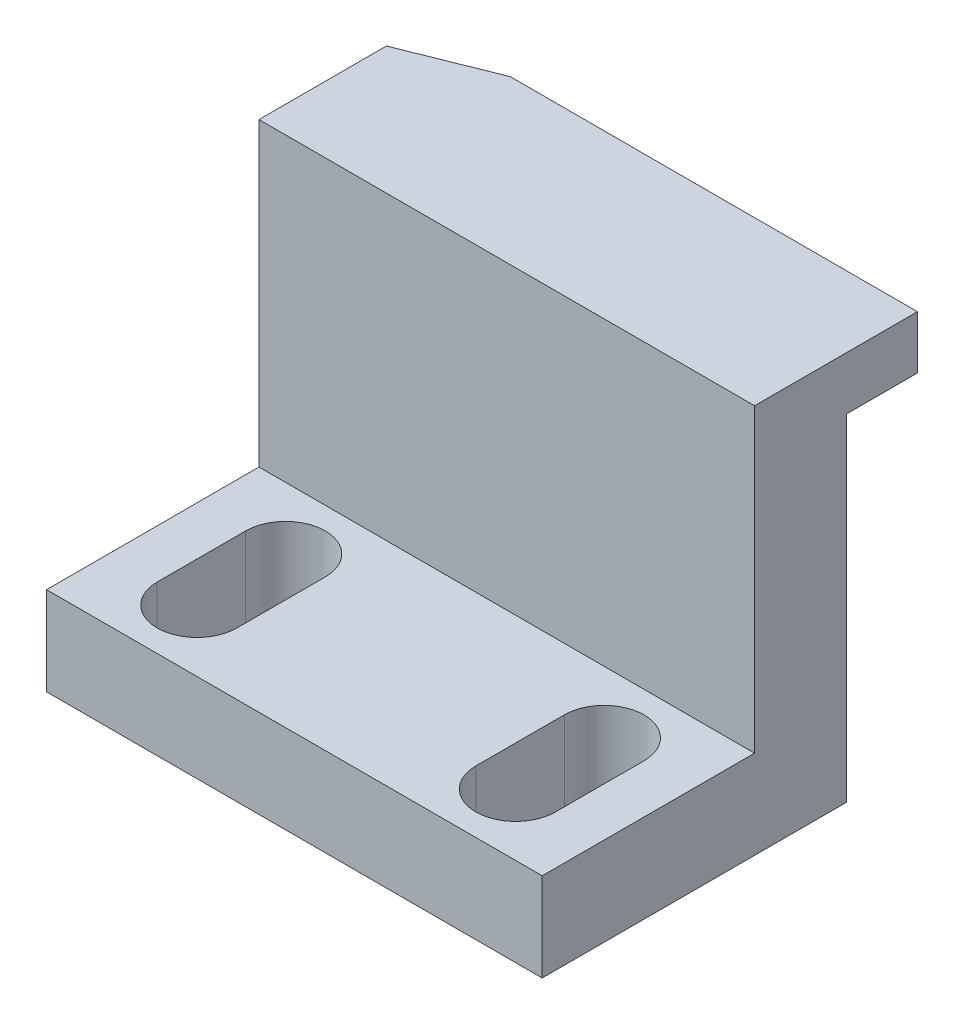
ISO-10303-21;
HEADER;
FILE_DESCRIPTION(('STEP AP214'),'2;1');
FILE_NAME('part.step','',(''),(''),'','','');
FILE_SCHEMA(('AUTOMOTIVE_DESIGN { 1 0 10303 214 1 1 1 1 }'));
ENDSEC;
DATA;
#1=APPLICATION_CONTEXT('core data for automotive mechanical design processes');
#2=APPLICATION_PROTOCOL_DEFINITION('international standard','automotive_design',2000,#1);
#3=PRODUCT_CONTEXT('',#1,'mechanical');
#4=PRODUCT('Part','Part','',(#3));
#5=PRODUCT_RELATED_PRODUCT_CATEGORY('part','',(#4));
#6=PRODUCT_DEFINITION_FORMATION('','',#4);
#7=PRODUCT_DEFINITION_CONTEXT('part definition',#1,'design');
#8=PRODUCT_DEFINITION('design','',#6,#7);
#9=PRODUCT_DEFINITION_SHAPE('','',#8);
#10=(LENGTH_UNIT() NAMED_UNIT(*) SI_UNIT(.MILLI.,.METRE.));
#11=(NAMED_UNIT(*) PLANE_ANGLE_UNIT() SI_UNIT($,.RADIAN.));
#12=(NAMED_UNIT(*) SI_UNIT($,.STERADIAN.) SOLID_ANGLE_UNIT());
#13=UNCERTAINTY_MEASURE_WITH_UNIT(LENGTH_MEASURE(1.E-05),#10,'distance_accuracy_value','');
#14=(GEOMETRIC_REPRESENTATION_CONTEXT(3) GLOBAL_UNCERTAINTY_ASSIGNED_CONTEXT((#13)) GLOBAL_UNIT_ASSIGNED_CONTEXT((#10,
#11,#12)) REPRESENTATION_CONTEXT('',''));
#15=CARTESIAN_POINT('',(0.,0.,0.));
#16=DIRECTION('',(0.,0.,1.));
#17=DIRECTION('',(1.,0.,0.));
#18=AXIS2_PLACEMENT_3D('',#15,#16,#17);
#19=CARTESIAN_POINT('',(0.,22.,21.2));
#20=DIRECTION('',(0.,-1.,0.));
#21=DIRECTION('',(0.,0.,-1.));
#22=AXIS2_PLACEMENT_3D('',#19,#20,#21);
#23=PLANE('',#22);
#24=DIRECTION('',(-0.928476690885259,0.,0.371390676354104));
#25=VECTOR('',#24,1.);
#26=CARTESIAN_POINT('',(-3.63797880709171E-12,22.,2.));
#27=LINE('',#26,#25);
#28=CARTESIAN_POINT('',(4.99999999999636,22.,0.));
#29=VERTEX_POINT('',#28);
#30=CARTESIAN_POINT('',(-3.63797880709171E-12,22.,2.));
#31=VERTEX_POINT('',#30);
#32=EDGE_CURVE('E151',#29,#31,#27,.T.);
#33=ORIENTED_EDGE('',*,*,#32,.T.);
#34=DIRECTION('',(0.,0.,-1.));
#35=VECTOR('',#34,1.);
#36=CARTESIAN_POINT('',(0.,22.,21.2));
#37=LINE('',#36,#35);
#38=CARTESIAN_POINT('',(0.,22.0000000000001,9.19999999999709));
#39=VERTEX_POINT('',#38);
#40=EDGE_CURVE('E185',#39,#31,#37,.T.);
#41=ORIENTED_EDGE('',*,*,#40,.F.);
#42=DIRECTION('',(1.,0.,0.));
#43=VECTOR('',#42,1.);
#44=CARTESIAN_POINT('',(0.,22.0000000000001,9.19999999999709));
#45=LINE('',#44,#43);
#46=CARTESIAN_POINT('',(28.,22.0000000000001,9.19999999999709));
#47=VERTEX_POINT('',#46);
#48=EDGE_CURVE('E284',#39,#47,#45,.T.);
#49=ORIENTED_EDGE('',*,*,#48,.T.);
#50=DIRECTION('',(0.,0.,-1.));
#51=VECTOR('',#50,1.);
#52=CARTESIAN_POINT('',(28.,22.,21.2));
#53=LINE('',#52,#51);
#54=CARTESIAN_POINT('',(28.,22.,0.));
#55=VERTEX_POINT('',#54);
#56=EDGE_CURVE('E170',#47,#55,#53,.T.);
#57=ORIENTED_EDGE('',*,*,#56,.T.);
#58=DIRECTION('',(-1.,0.,0.));
#59=VECTOR('',#58,1.);
#60=CARTESIAN_POINT('',(0.,22.,0.));
#61=LINE('',#60,#59);
#62=EDGE_CURVE('E165',#55,#29,#61,.T.);
#63=ORIENTED_EDGE('',*,*,#62,.T.);
#64=EDGE_LOOP('',(#33,#41,#49,#57,#63));
#65=FACE_BOUND('',#64,.T.);
#66=ADVANCED_FACE('F34',(#65),#23,.F.);
#67=CARTESIAN_POINT('',(0.,-1.13686837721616E-13,21.2));
#68=DIRECTION('',(1.,0.,0.));
#69=DIRECTION('',(0.,0.,-1.));
#70=AXIS2_PLACEMENT_3D('',#67,#68,#69);
#71=PLANE('',#70);
#72=DIRECTION('',(0.,1.,0.));
#73=VECTOR('',#72,1.);
#74=CARTESIAN_POINT('',(-3.63797880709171E-12,-1.14491749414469E-13,2.));
#75=LINE('',#74,#73);
#76=CARTESIAN_POINT('',(-3.63797880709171E-12,19.0000000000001,2.));
#77=VERTEX_POINT('',#76);
#78=EDGE_CURVE('E154',#77,#31,#75,.T.);
#79=ORIENTED_EDGE('',*,*,#78,.F.);
#80=DIRECTION('',(0.,0.,-1.));
#81=VECTOR('',#80,1.);
#82=CARTESIAN_POINT('',(0.,19.0000000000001,4.));
#83=LINE('',#82,#81);
#84=CARTESIAN_POINT('',(0.,19.0000000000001,4.));
#85=VERTEX_POINT('',#84);
#86=EDGE_CURVE('E261',#85,#77,#83,.T.);
#87=ORIENTED_EDGE('',*,*,#86,.F.);
#88=DIRECTION('',(0.,1.,0.));
#89=VECTOR('',#88,1.);
#90=CARTESIAN_POINT('',(0.,1.13686837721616E-13,4.));
#91=LINE('',#90,#89);
#92=CARTESIAN_POINT('',(0.,1.13686837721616E-13,4.));
#93=VERTEX_POINT('',#92);
#94=EDGE_CURVE('E258',#93,#85,#91,.T.);
#95=ORIENTED_EDGE('',*,*,#94,.F.);
#96=DIRECTION('',(0.,0.,-1.));
#97=VECTOR('',#96,1.);
#98=CARTESIAN_POINT('',(0.,-1.13686837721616E-13,21.2));
#99=LINE('',#98,#97);
#100=CARTESIAN_POINT('',(0.,-1.13686837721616E-13,21.2));
#101=VERTEX_POINT('',#100);
#102=EDGE_CURVE('E182',#101,#93,#99,.T.);
#103=ORIENTED_EDGE('',*,*,#102,.F.);
#104=DIRECTION('',(0.,-1.,0.));
#105=VECTOR('',#104,1.);
#106=CARTESIAN_POINT('',(0.,-1.13686837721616E-13,21.2));
#107=LINE('',#106,#105);
#108=CARTESIAN_POINT('',(0.,5.00000000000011,21.2));
#109=VERTEX_POINT('',#108);
#110=EDGE_CURVE('E186',#109,#101,#107,.T.);
#111=ORIENTED_EDGE('',*,*,#110,.F.);
#112=DIRECTION('',(0.,0.,1.));
#113=VECTOR('',#112,1.);
#114=CARTESIAN_POINT('',(0.,5.00000000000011,21.1999999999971));
#115=LINE('',#114,#113);
#116=CARTESIAN_POINT('',(0.,5.00000000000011,9.19999999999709));
#117=VERTEX_POINT('',#116);
#118=EDGE_CURVE('E268',#117,#109,#115,.T.);
#119=ORIENTED_EDGE('',*,*,#118,.F.);
#120=DIRECTION('',(0.,-1.,0.));
#121=VECTOR('',#120,1.);
#122=CARTESIAN_POINT('',(0.,5.00000000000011,9.19999999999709));
#123=LINE('',#122,#121);
#124=EDGE_CURVE('E265',#39,#117,#123,.T.);
#125=ORIENTED_EDGE('',*,*,#124,.F.);
#126=ORIENTED_EDGE('',*,*,#40,.T.);
#127=EDGE_LOOP('',(#79,#87,#95,#103,#111,#119,#125,#126));
#128=FACE_BOUND('',#127,.T.);
#129=ADVANCED_FACE('F302',(#128),#71,.F.);
#130=CARTESIAN_POINT('',(28.,-1.13686837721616E-13,0.));
#131=DIRECTION('',(0.,0.,1.));
#132=DIRECTION('',(1.,0.,0.));
#133=AXIS2_PLACEMENT_3D('',#130,#131,#132);
#134=PLANE('',#133);
#135=DIRECTION('',(0.,1.,0.));
#136=VECTOR('',#135,1.);
#137=CARTESIAN_POINT('',(4.99999999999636,-1.14491749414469E-13,0.));
#138=LINE('',#137,#136);
#139=CARTESIAN_POINT('',(4.99999999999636,19.0000000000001,0.));
#140=VERTEX_POINT('',#139);
#141=EDGE_CURVE('E49',#140,#29,#138,.T.);
#142=ORIENTED_EDGE('',*,*,#141,.T.);
#143=ORIENTED_EDGE('',*,*,#62,.F.);
#144=DIRECTION('',(0.,1.,0.));
#145=VECTOR('',#144,1.);
#146=CARTESIAN_POINT('',(28.,-1.13686837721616E-13,0.));
#147=LINE('',#146,#145);
#148=CARTESIAN_POINT('',(28.,19.0000000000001,0.));
#149=VERTEX_POINT('',#148);
#150=EDGE_CURVE('E173',#149,#55,#147,.T.);
#151=ORIENTED_EDGE('',*,*,#150,.F.);
#152=DIRECTION('',(1.,0.,0.));
#153=VECTOR('',#152,1.);
#154=CARTESIAN_POINT('',(0.,19.0000000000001,0.));
#155=LINE('',#154,#153);
#156=EDGE_CURVE('E166',#140,#149,#155,.T.);
#157=ORIENTED_EDGE('',*,*,#156,.F.);
#158=EDGE_LOOP('',(#142,#143,#151,#157));
#159=FACE_BOUND('',#158,.T.);
#160=ADVANCED_FACE('F163',(#159),#134,.F.);
#161=CARTESIAN_POINT('',(0.,19.0000000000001,4.));
#162=DIRECTION('',(0.,-1.,0.));
#163=DIRECTION('',(0.,0.,-1.));
#164=AXIS2_PLACEMENT_3D('',#161,#162,#163);
#165=PLANE('',#164);
#166=ORIENTED_EDGE('',*,*,#86,.T.);
#167=DIRECTION('',(0.928476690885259,0.,-0.371390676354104));
#168=VECTOR('',#167,1.);
#169=CARTESIAN_POINT('',(-0.689655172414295,19.0000000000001,2.27586206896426));
#170=LINE('',#169,#168);
#171=EDGE_CURVE('E12',#77,#140,#170,.T.);
#172=ORIENTED_EDGE('',*,*,#171,.T.);
#173=ORIENTED_EDGE('',*,*,#156,.T.);
#174=DIRECTION('',(0.,0.,-1.));
#175=VECTOR('',#174,1.);
#176=CARTESIAN_POINT('',(28.,19.0000000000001,4.));
#177=LINE('',#176,#175);
#178=CARTESIAN_POINT('',(28.,19.0000000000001,4.));
#179=VERTEX_POINT('',#178);
#180=EDGE_CURVE('E273',#179,#149,#177,.T.);
#181=ORIENTED_EDGE('',*,*,#180,.F.);
#182=DIRECTION('',(1.,0.,0.));
#183=VECTOR('',#182,1.);
#184=CARTESIAN_POINT('',(0.,19.0000000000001,4.));
#185=LINE('',#184,#183);
#186=EDGE_CURVE('E287',#85,#179,#185,.T.);
#187=ORIENTED_EDGE('',*,*,#186,.F.);
#188=EDGE_LOOP('',(#166,#172,#173,#181,#187));
#189=FACE_BOUND('',#188,.T.);
#190=ADVANCED_FACE('F313',(#189),#165,.T.);
#191=CARTESIAN_POINT('',(0.,-1.13686837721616E-13,21.2));
#192=DIRECTION('',(0.,1.,0.));
#193=DIRECTION('',(0.,0.,1.));
#194=AXIS2_PLACEMENT_3D('',#191,#192,#193);
#195=PLANE('',#194);
#196=DIRECTION('',(0.,0.,1.));
#197=VECTOR('',#196,1.);
#198=CARTESIAN_POINT('',(2.74999999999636,-1.14491749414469E-13,12.6999999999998));
#199=LINE('',#198,#197);
#200=CARTESIAN_POINT('',(2.74999999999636,-1.14491749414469E-13,12.6999999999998));
#201=VERTEX_POINT('',#200);
#202=CARTESIAN_POINT('',(2.74999999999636,-1.14491749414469E-13,17.6999999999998));
#203=VERTEX_POINT('',#202);
#204=EDGE_CURVE('E230',#201,#203,#199,.T.);
#205=ORIENTED_EDGE('',*,*,#204,.T.);
#206=CARTESIAN_POINT('',(4.99999999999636,-1.14491749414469E-13,17.6999999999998));
#207=DIRECTION('',(0.,1.,0.));
#208=DIRECTION('',(0.,0.,1.));
#209=AXIS2_PLACEMENT_3D('',#206,#207,#208);
#210=CIRCLE('',#209,2.25);
#211=CARTESIAN_POINT('',(7.24999999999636,-1.14491749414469E-13,17.6999999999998));
#212=VERTEX_POINT('',#211);
#213=EDGE_CURVE('E314',#203,#212,#210,.T.);
#214=ORIENTED_EDGE('',*,*,#213,.T.);
#215=DIRECTION('',(0.,0.,-1.));
#216=VECTOR('',#215,1.);
#217=CARTESIAN_POINT('',(7.24999999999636,-1.14491749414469E-13,17.6999999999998));
#218=LINE('',#217,#216);
#219=CARTESIAN_POINT('',(7.24999999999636,-1.13686837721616E-13,12.6999999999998));
#220=VERTEX_POINT('',#219);
#221=EDGE_CURVE('E317',#212,#220,#218,.T.);
#222=ORIENTED_EDGE('',*,*,#221,.T.);
#223=CARTESIAN_POINT('',(4.99999999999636,-1.14491749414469E-13,12.6999999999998));
#224=DIRECTION('',(0.,1.,0.));
#225=DIRECTION('',(0.,0.,1.));
#226=AXIS2_PLACEMENT_3D('',#223,#224,#225);
#227=CIRCLE('',#226,2.25);
#228=EDGE_CURVE('E56',#220,#201,#227,.T.);
#229=ORIENTED_EDGE('',*,*,#228,.T.);
#230=EDGE_LOOP('',(#205,#214,#222,#229));
#231=FACE_BOUND('',#230,.T.);
#232=DIRECTION('',(0.,0.,1.));
#233=VECTOR('',#232,1.);
#234=CARTESIAN_POINT('',(20.7499999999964,-1.14491749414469E-13,12.6999999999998));
#235=LINE('',#234,#233);
#236=CARTESIAN_POINT('',(20.7499999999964,-1.14491749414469E-13,12.6999999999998));
#237=VERTEX_POINT('',#236);
#238=CARTESIAN_POINT('',(20.7499999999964,-1.14491749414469E-13,17.6999999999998));
#239=VERTEX_POINT('',#238);
#240=EDGE_CURVE('E243',#237,#239,#235,.T.);
#241=ORIENTED_EDGE('',*,*,#240,.T.);
#242=CARTESIAN_POINT('',(22.9999999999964,-1.14491749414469E-13,17.6999999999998));
#243=DIRECTION('',(0.,1.,0.));
#244=DIRECTION('',(0.,0.,1.));
#245=AXIS2_PLACEMENT_3D('',#242,#243,#244);
#246=CIRCLE('',#245,2.25);
#247=CARTESIAN_POINT('',(25.2499999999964,-1.14491749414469E-13,17.6999999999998));
#248=VERTEX_POINT('',#247);
#249=EDGE_CURVE('E234',#239,#248,#246,.T.);
#250=ORIENTED_EDGE('',*,*,#249,.T.);
#251=DIRECTION('',(0.,0.,-1.));
#252=VECTOR('',#251,1.);
#253=CARTESIAN_POINT('',(25.2499999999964,-1.14491749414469E-13,17.6999999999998));
#254=LINE('',#253,#252);
#255=CARTESIAN_POINT('',(25.2499999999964,-1.13686837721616E-13,12.6999999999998));
#256=VERTEX_POINT('',#255);
#257=EDGE_CURVE('E237',#248,#256,#254,.T.);
#258=ORIENTED_EDGE('',*,*,#257,.T.);
#259=CARTESIAN_POINT('',(22.9999999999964,-1.14491749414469E-13,12.6999999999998));
#260=DIRECTION('',(0.,1.,0.));
#261=DIRECTION('',(0.,0.,1.));
#262=AXIS2_PLACEMENT_3D('',#259,#260,#261);
#263=CIRCLE('',#262,2.25);
#264=EDGE_CURVE('E240',#256,#237,#263,.T.);
#265=ORIENTED_EDGE('',*,*,#264,.T.);
#266=EDGE_LOOP('',(#241,#250,#258,#265));
#267=FACE_BOUND('',#266,.T.);
#268=DIRECTION('',(1.,0.,0.));
#269=VECTOR('',#268,1.);
#270=CARTESIAN_POINT('',(0.,1.13686837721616E-13,4.));
#271=LINE('',#270,#269);
#272=CARTESIAN_POINT('',(28.,1.12757025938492E-13,4.));
#273=VERTEX_POINT('',#272);
#274=EDGE_CURVE('E270',#93,#273,#271,.T.);
#275=ORIENTED_EDGE('',*,*,#274,.T.);
#276=DIRECTION('',(0.,0.,-1.));
#277=VECTOR('',#276,1.);
#278=CARTESIAN_POINT('',(28.,-1.13686837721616E-13,21.2));
#279=LINE('',#278,#277);
#280=CARTESIAN_POINT('',(28.,-1.13686837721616E-13,21.2));
#281=VERTEX_POINT('',#280);
#282=EDGE_CURVE('E189',#281,#273,#279,.T.);
#283=ORIENTED_EDGE('',*,*,#282,.F.);
#284=DIRECTION('',(1.,0.,0.));
#285=VECTOR('',#284,1.);
#286=CARTESIAN_POINT('',(0.,-1.13686837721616E-13,21.2));
#287=LINE('',#286,#285);
#288=EDGE_CURVE('E172',#101,#281,#287,.T.);
#289=ORIENTED_EDGE('',*,*,#288,.F.);
#290=ORIENTED_EDGE('',*,*,#102,.T.);
#291=EDGE_LOOP('',(#275,#283,#289,#290));
#292=FACE_BOUND('',#291,.T.);
#293=ADVANCED_FACE('F36',(#231,#267,#292),#195,.F.);
#294=CARTESIAN_POINT('',(28.,-1.13686837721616E-13,21.2));
#295=DIRECTION('',(-1.,0.,0.));
#296=DIRECTION('',(0.,0.,1.));
#297=AXIS2_PLACEMENT_3D('',#294,#295,#296);
#298=PLANE('',#297);
#299=DIRECTION('',(0.,0.,1.));
#300=VECTOR('',#299,1.);
#301=CARTESIAN_POINT('',(28.,5.00000000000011,21.1999999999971));
#302=LINE('',#301,#300);
#303=CARTESIAN_POINT('',(28.,5.00000000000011,9.19999999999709));
#304=VERTEX_POINT('',#303);
#305=CARTESIAN_POINT('',(28.,5.00000000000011,21.1999999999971));
#306=VERTEX_POINT('',#305);
#307=EDGE_CURVE('E262',#304,#306,#302,.T.);
#308=ORIENTED_EDGE('',*,*,#307,.T.);
#309=DIRECTION('',(0.,1.,0.));
#310=VECTOR('',#309,1.);
#311=CARTESIAN_POINT('',(28.,-1.13686837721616E-13,21.2));
#312=LINE('',#311,#310);
#313=EDGE_CURVE('E176',#281,#306,#312,.T.);
#314=ORIENTED_EDGE('',*,*,#313,.F.);
#315=ORIENTED_EDGE('',*,*,#282,.T.);
#316=DIRECTION('',(0.,1.,0.));
#317=VECTOR('',#316,1.);
#318=CARTESIAN_POINT('',(28.,1.13686837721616E-13,4.));
#319=LINE('',#318,#317);
#320=EDGE_CURVE('E250',#273,#179,#319,.T.);
#321=ORIENTED_EDGE('',*,*,#320,.T.);
#322=ORIENTED_EDGE('',*,*,#180,.T.);
#323=ORIENTED_EDGE('',*,*,#150,.T.);
#324=ORIENTED_EDGE('',*,*,#56,.F.);
#325=DIRECTION('',(0.,-1.,0.));
#326=VECTOR('',#325,1.);
#327=CARTESIAN_POINT('',(28.,5.00000000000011,9.19999999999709));
#328=LINE('',#327,#326);
#329=EDGE_CURVE('E276',#47,#304,#328,.T.);
#330=ORIENTED_EDGE('',*,*,#329,.T.);
#331=EDGE_LOOP('',(#308,#314,#315,#321,#322,#323,#324,#330));
#332=FACE_BOUND('',#331,.T.);
#333=ADVANCED_FACE('F306',(#332),#298,.F.);
#334=CARTESIAN_POINT('',(28.,-1.13686837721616E-13,21.2));
#335=DIRECTION('',(0.,0.,1.));
#336=DIRECTION('',(1.,0.,0.));
#337=AXIS2_PLACEMENT_3D('',#334,#335,#336);
#338=PLANE('',#337);
#339=ORIENTED_EDGE('',*,*,#313,.T.);
#340=DIRECTION('',(1.,0.,0.));
#341=VECTOR('',#340,1.);
#342=CARTESIAN_POINT('',(0.,5.00000000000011,21.1999999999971));
#343=LINE('',#342,#341);
#344=EDGE_CURVE('E178',#109,#306,#343,.T.);
#345=ORIENTED_EDGE('',*,*,#344,.F.);
#346=ORIENTED_EDGE('',*,*,#110,.T.);
#347=ORIENTED_EDGE('',*,*,#288,.T.);
#348=EDGE_LOOP('',(#339,#345,#346,#347));
#349=FACE_BOUND('',#348,.T.);
#350=ADVANCED_FACE('F296',(#349),#338,.T.);
#351=CARTESIAN_POINT('',(0.,1.13686837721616E-13,4.));
#352=DIRECTION('',(0.,0.,-1.));
#353=DIRECTION('',(-1.,0.,0.));
#354=AXIS2_PLACEMENT_3D('',#351,#352,#353);
#355=PLANE('',#354);
#356=ORIENTED_EDGE('',*,*,#320,.F.);
#357=ORIENTED_EDGE('',*,*,#274,.F.);
#358=ORIENTED_EDGE('',*,*,#94,.T.);
#359=ORIENTED_EDGE('',*,*,#186,.T.);
#360=EDGE_LOOP('',(#356,#357,#358,#359));
#361=FACE_BOUND('',#360,.T.);
#362=ADVANCED_FACE('F350',(#361),#355,.T.);
#363=CARTESIAN_POINT('',(0.,5.00000000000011,21.1999999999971));
#364=DIRECTION('',(0.,1.,0.));
#365=DIRECTION('',(0.,0.,1.));
#366=AXIS2_PLACEMENT_3D('',#363,#364,#365);
#367=PLANE('',#366);
#368=CARTESIAN_POINT('',(4.99999999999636,5.00000000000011,17.6999999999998));
#369=DIRECTION('',(0.,1.,0.));
#370=DIRECTION('',(0.,0.,1.));
#371=AXIS2_PLACEMENT_3D('',#368,#369,#370);
#372=CIRCLE('',#371,2.25);
#373=CARTESIAN_POINT('',(2.74999999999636,5.00000000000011,17.6999999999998));
#374=VERTEX_POINT('',#373);
#375=CARTESIAN_POINT('',(7.24999999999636,5.00000000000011,17.6999999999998));
#376=VERTEX_POINT('',#375);
#377=EDGE_CURVE('E42',#374,#376,#372,.T.);
#378=ORIENTED_EDGE('',*,*,#377,.F.);
#379=DIRECTION('',(0.,0.,1.));
#380=VECTOR('',#379,1.);
#381=CARTESIAN_POINT('',(2.74999999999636,5.00000000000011,21.1999999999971));
#382=LINE('',#381,#380);
#383=CARTESIAN_POINT('',(2.74999999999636,5.00000000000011,12.6999999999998));
#384=VERTEX_POINT('',#383);
#385=EDGE_CURVE('E205',#384,#374,#382,.T.);
#386=ORIENTED_EDGE('',*,*,#385,.F.);
#387=CARTESIAN_POINT('',(4.99999999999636,5.00000000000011,12.6999999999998));
#388=DIRECTION('',(0.,1.,0.));
#389=DIRECTION('',(0.,0.,1.));
#390=AXIS2_PLACEMENT_3D('',#387,#388,#389);
#391=CIRCLE('',#390,2.25);
#392=CARTESIAN_POINT('',(7.24999999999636,5.00000000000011,12.6999999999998));
#393=VERTEX_POINT('',#392);
#394=EDGE_CURVE('E203',#393,#384,#391,.T.);
#395=ORIENTED_EDGE('',*,*,#394,.F.);
#396=DIRECTION('',(0.,0.,-1.));
#397=VECTOR('',#396,1.);
#398=CARTESIAN_POINT('',(7.24999999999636,5.00000000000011,21.1999999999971));
#399=LINE('',#398,#397);
#400=EDGE_CURVE('E201',#376,#393,#399,.T.);
#401=ORIENTED_EDGE('',*,*,#400,.F.);
#402=EDGE_LOOP('',(#378,#386,#395,#401));
#403=FACE_BOUND('',#402,.T.);
#404=CARTESIAN_POINT('',(22.9999999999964,5.00000000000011,17.6999999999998));
#405=DIRECTION('',(0.,1.,0.));
#406=DIRECTION('',(0.,0.,1.));
#407=AXIS2_PLACEMENT_3D('',#404,#405,#406);
#408=CIRCLE('',#407,2.25);
#409=CARTESIAN_POINT('',(20.7499999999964,5.00000000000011,17.6999999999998));
#410=VERTEX_POINT('',#409);
#411=CARTESIAN_POINT('',(25.2499999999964,5.00000000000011,17.6999999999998));
#412=VERTEX_POINT('',#411);
#413=EDGE_CURVE('E198',#410,#412,#408,.T.);
#414=ORIENTED_EDGE('',*,*,#413,.F.);
#415=DIRECTION('',(0.,0.,1.));
#416=VECTOR('',#415,1.);
#417=CARTESIAN_POINT('',(20.7499999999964,5.00000000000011,21.1999999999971));
#418=LINE('',#417,#416);
#419=CARTESIAN_POINT('',(20.7499999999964,5.00000000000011,12.6999999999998));
#420=VERTEX_POINT('',#419);
#421=EDGE_CURVE('E196',#420,#410,#418,.T.);
#422=ORIENTED_EDGE('',*,*,#421,.F.);
#423=CARTESIAN_POINT('',(22.9999999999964,5.00000000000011,12.6999999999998));
#424=DIRECTION('',(0.,1.,0.));
#425=DIRECTION('',(0.,0.,1.));
#426=AXIS2_PLACEMENT_3D('',#423,#424,#425);
#427=CIRCLE('',#426,2.25);
#428=CARTESIAN_POINT('',(25.2499999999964,5.00000000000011,12.6999999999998));
#429=VERTEX_POINT('',#428);
#430=EDGE_CURVE('E194',#429,#420,#427,.T.);
#431=ORIENTED_EDGE('',*,*,#430,.F.);
#432=DIRECTION('',(0.,0.,-1.));
#433=VECTOR('',#432,1.);
#434=CARTESIAN_POINT('',(25.2499999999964,5.00000000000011,21.1999999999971));
#435=LINE('',#434,#433);
#436=EDGE_CURVE('E192',#412,#429,#435,.T.);
#437=ORIENTED_EDGE('',*,*,#436,.F.);
#438=EDGE_LOOP('',(#414,#422,#431,#437));
#439=FACE_BOUND('',#438,.T.);
#440=ORIENTED_EDGE('',*,*,#307,.F.);
#441=DIRECTION('',(1.,0.,0.));
#442=VECTOR('',#441,1.);
#443=CARTESIAN_POINT('',(0.,5.00000000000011,9.19999999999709));
#444=LINE('',#443,#442);
#445=EDGE_CURVE('E282',#117,#304,#444,.T.);
#446=ORIENTED_EDGE('',*,*,#445,.F.);
#447=ORIENTED_EDGE('',*,*,#118,.T.);
#448=ORIENTED_EDGE('',*,*,#344,.T.);
#449=EDGE_LOOP('',(#440,#446,#447,#448));
#450=FACE_BOUND('',#449,.T.);
#451=ADVANCED_FACE('F219',(#403,#439,#450),#367,.T.);
#452=CARTESIAN_POINT('',(0.,5.00000000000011,9.19999999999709));
#453=DIRECTION('',(0.,0.,1.));
#454=DIRECTION('',(1.,0.,0.));
#455=AXIS2_PLACEMENT_3D('',#452,#453,#454);
#456=PLANE('',#455);
#457=ORIENTED_EDGE('',*,*,#329,.F.);
#458=ORIENTED_EDGE('',*,*,#48,.F.);
#459=ORIENTED_EDGE('',*,*,#124,.T.);
#460=ORIENTED_EDGE('',*,*,#445,.T.);
#461=EDGE_LOOP('',(#457,#458,#459,#460));
#462=FACE_BOUND('',#461,.T.);
#463=ADVANCED_FACE('F361',(#462),#456,.T.);
#464=CARTESIAN_POINT('',(22.9999999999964,-1.14491749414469E-13,17.6999999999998));
#465=DIRECTION('',(0.,1.,0.));
#466=DIRECTION('',(0.,0.,1.));
#467=AXIS2_PLACEMENT_3D('',#464,#465,#466);
#468=CYLINDRICAL_SURFACE('',#467,2.25);
#469=ORIENTED_EDGE('',*,*,#413,.T.);
#470=DIRECTION('',(0.,1.,0.));
#471=VECTOR('',#470,1.);
#472=CARTESIAN_POINT('',(25.2499999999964,-1.14491749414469E-13,17.6999999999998));
#473=LINE('',#472,#471);
#474=EDGE_CURVE('E246',#248,#412,#473,.T.);
#475=ORIENTED_EDGE('',*,*,#474,.F.);
#476=ORIENTED_EDGE('',*,*,#249,.F.);
#477=DIRECTION('',(0.,1.,0.));
#478=VECTOR('',#477,1.);
#479=CARTESIAN_POINT('',(20.7499999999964,-1.14491749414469E-13,17.6999999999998));
#480=LINE('',#479,#478);
#481=EDGE_CURVE('E247',#239,#410,#480,.T.);
#482=ORIENTED_EDGE('',*,*,#481,.T.);
#483=EDGE_LOOP('',(#469,#475,#476,#482));
#484=FACE_BOUND('',#483,.T.);
#485=ADVANCED_FACE('F371',(#484),#468,.F.);
#486=CARTESIAN_POINT('',(20.7499999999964,-1.14491749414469E-13,12.6999999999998));
#487=DIRECTION('',(-1.,0.,0.));
#488=DIRECTION('',(0.,0.,1.));
#489=AXIS2_PLACEMENT_3D('',#486,#487,#488);
#490=PLANE('',#489);
#491=ORIENTED_EDGE('',*,*,#421,.T.);
#492=ORIENTED_EDGE('',*,*,#481,.F.);
#493=ORIENTED_EDGE('',*,*,#240,.F.);
#494=DIRECTION('',(0.,1.,0.));
#495=VECTOR('',#494,1.);
#496=CARTESIAN_POINT('',(20.7499999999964,-1.14491749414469E-13,12.6999999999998));
#497=LINE('',#496,#495);
#498=EDGE_CURVE('E251',#237,#420,#497,.T.);
#499=ORIENTED_EDGE('',*,*,#498,.T.);
#500=EDGE_LOOP('',(#491,#492,#493,#499));
#501=FACE_BOUND('',#500,.T.);
#502=ADVANCED_FACE('F375',(#501),#490,.F.);
#503=CARTESIAN_POINT('',(22.9999999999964,-1.14491749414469E-13,12.6999999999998));
#504=DIRECTION('',(0.,1.,0.));
#505=DIRECTION('',(0.,0.,1.));
#506=AXIS2_PLACEMENT_3D('',#503,#504,#505);
#507=CYLINDRICAL_SURFACE('',#506,2.25);
#508=ORIENTED_EDGE('',*,*,#430,.T.);
#509=ORIENTED_EDGE('',*,*,#498,.F.);
#510=ORIENTED_EDGE('',*,*,#264,.F.);
#511=DIRECTION('',(0.,1.,0.));
#512=VECTOR('',#511,1.);
#513=CARTESIAN_POINT('',(25.2499999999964,-1.14491749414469E-13,12.6999999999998));
#514=LINE('',#513,#512);
#515=EDGE_CURVE('E254',#256,#429,#514,.T.);
#516=ORIENTED_EDGE('',*,*,#515,.T.);
#517=EDGE_LOOP('',(#508,#509,#510,#516));
#518=FACE_BOUND('',#517,.T.);
#519=ADVANCED_FACE('F379',(#518),#507,.F.);
#520=CARTESIAN_POINT('',(25.2499999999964,-1.14491749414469E-13,17.6999999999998));
#521=DIRECTION('',(1.,0.,0.));
#522=DIRECTION('',(0.,0.,-1.));
#523=AXIS2_PLACEMENT_3D('',#520,#521,#522);
#524=PLANE('',#523);
#525=ORIENTED_EDGE('',*,*,#436,.T.);
#526=ORIENTED_EDGE('',*,*,#515,.F.);
#527=ORIENTED_EDGE('',*,*,#257,.F.);
#528=ORIENTED_EDGE('',*,*,#474,.T.);
#529=EDGE_LOOP('',(#525,#526,#527,#528));
#530=FACE_BOUND('',#529,.T.);
#531=ADVANCED_FACE('F335',(#530),#524,.F.);
#532=CARTESIAN_POINT('',(4.99999999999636,-1.14491749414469E-13,17.6999999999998));
#533=DIRECTION('',(0.,1.,0.));
#534=DIRECTION('',(0.,0.,1.));
#535=AXIS2_PLACEMENT_3D('',#532,#533,#534);
#536=CYLINDRICAL_SURFACE('',#535,2.25);
#537=ORIENTED_EDGE('',*,*,#377,.T.);
#538=DIRECTION('',(0.,1.,0.));
#539=VECTOR('',#538,1.);
#540=CARTESIAN_POINT('',(7.24999999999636,-1.14491749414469E-13,17.6999999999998));
#541=LINE('',#540,#539);
#542=EDGE_CURVE('E213',#212,#376,#541,.T.);
#543=ORIENTED_EDGE('',*,*,#542,.F.);
#544=ORIENTED_EDGE('',*,*,#213,.F.);
#545=DIRECTION('',(0.,1.,0.));
#546=VECTOR('',#545,1.);
#547=CARTESIAN_POINT('',(2.74999999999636,-1.14491749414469E-13,17.6999999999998));
#548=LINE('',#547,#546);
#549=EDGE_CURVE('E215',#203,#374,#548,.T.);
#550=ORIENTED_EDGE('',*,*,#549,.T.);
#551=EDGE_LOOP('',(#537,#543,#544,#550));
#552=FACE_BOUND('',#551,.T.);
#553=ADVANCED_FACE('F211',(#552),#536,.F.);
#554=CARTESIAN_POINT('',(2.74999999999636,-1.14491749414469E-13,12.6999999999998));
#555=DIRECTION('',(-1.,0.,0.));
#556=DIRECTION('',(0.,0.,1.));
#557=AXIS2_PLACEMENT_3D('',#554,#555,#556);
#558=PLANE('',#557);
#559=ORIENTED_EDGE('',*,*,#385,.T.);
#560=ORIENTED_EDGE('',*,*,#549,.F.);
#561=ORIENTED_EDGE('',*,*,#204,.F.);
#562=DIRECTION('',(0.,1.,0.));
#563=VECTOR('',#562,1.);
#564=CARTESIAN_POINT('',(2.74999999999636,-1.14491749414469E-13,12.6999999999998));
#565=LINE('',#564,#563);
#566=EDGE_CURVE('E227',#201,#384,#565,.T.);
#567=ORIENTED_EDGE('',*,*,#566,.T.);
#568=EDGE_LOOP('',(#559,#560,#561,#567));
#569=FACE_BOUND('',#568,.T.);
#570=ADVANCED_FACE('F327',(#569),#558,.F.);
#571=CARTESIAN_POINT('',(4.99999999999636,-1.14491749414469E-13,12.6999999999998));
#572=DIRECTION('',(0.,1.,0.));
#573=DIRECTION('',(0.,0.,1.));
#574=AXIS2_PLACEMENT_3D('',#571,#572,#573);
#575=CYLINDRICAL_SURFACE('',#574,2.25);
#576=ORIENTED_EDGE('',*,*,#394,.T.);
#577=ORIENTED_EDGE('',*,*,#566,.F.);
#578=ORIENTED_EDGE('',*,*,#228,.F.);
#579=DIRECTION('',(0.,1.,0.));
#580=VECTOR('',#579,1.);
#581=CARTESIAN_POINT('',(7.24999999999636,-1.14491749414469E-13,12.6999999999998));
#582=LINE('',#581,#580);
#583=EDGE_CURVE('E223',#220,#393,#582,.T.);
#584=ORIENTED_EDGE('',*,*,#583,.T.);
#585=EDGE_LOOP('',(#576,#577,#578,#584));
#586=FACE_BOUND('',#585,.T.);
#587=ADVANCED_FACE('F225',(#586),#575,.F.);
#588=CARTESIAN_POINT('',(7.24999999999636,-1.14491749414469E-13,17.6999999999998));
#589=DIRECTION('',(1.,0.,0.));
#590=DIRECTION('',(0.,0.,-1.));
#591=AXIS2_PLACEMENT_3D('',#588,#589,#590);
#592=PLANE('',#591);
#593=ORIENTED_EDGE('',*,*,#400,.T.);
#594=ORIENTED_EDGE('',*,*,#583,.F.);
#595=ORIENTED_EDGE('',*,*,#221,.F.);
#596=ORIENTED_EDGE('',*,*,#542,.T.);
#597=EDGE_LOOP('',(#593,#594,#595,#596));
#598=FACE_BOUND('',#597,.T.);
#599=ADVANCED_FACE('F222',(#598),#592,.F.);
#600=CARTESIAN_POINT('',(-3.63797880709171E-12,-1.14491749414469E-13,2.));
#601=DIRECTION('',(-0.371390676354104,0.,-0.928476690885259));
#602=DIRECTION('',(-0.928476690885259,0.,0.371390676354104));
#603=AXIS2_PLACEMENT_3D('',#600,#601,#602);
#604=PLANE('',#603);
#605=ORIENTED_EDGE('',*,*,#78,.T.);
#606=ORIENTED_EDGE('',*,*,#32,.F.);
#607=ORIENTED_EDGE('',*,*,#141,.F.);
#608=ORIENTED_EDGE('',*,*,#171,.F.);
#609=EDGE_LOOP('',(#605,#606,#607,#608));
#610=FACE_BOUND('',#609,.T.);
#611=ADVANCED_FACE('F152',(#610),#604,.T.);
#612=CLOSED_SHELL('',(#66,#129,#160,#190,#293,#333,#350,#362,#451,#463,#485,#502,#519,#531,#553,
#570,#587,#599,#611));
#613=MANIFOLD_SOLID_BREP('B2',#612);
#614=ADVANCED_BREP_SHAPE_REPRESENTATION('',(#18,#613),#14);
#615=SHAPE_DEFINITION_REPRESENTATION(#9,#614);
ENDSEC;
END-ISO-10303-21;
